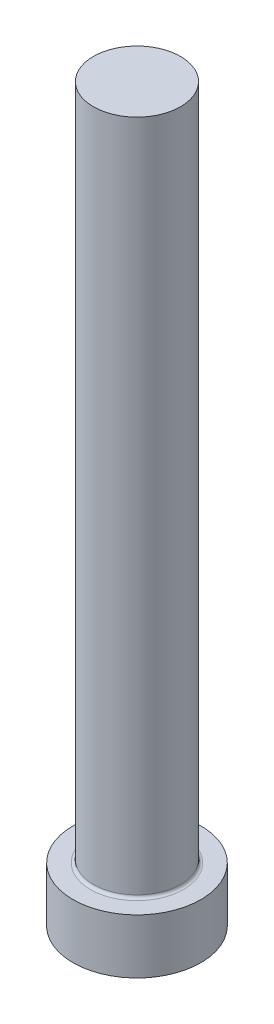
ISO-10303-21;
HEADER;
FILE_DESCRIPTION(('STEP AP214'),'2;1');
FILE_NAME('part.step','',(''),(''),'','','');
FILE_SCHEMA(('AUTOMOTIVE_DESIGN { 1 0 10303 214 1 1 1 1 }'));
ENDSEC;
DATA;
#1=APPLICATION_CONTEXT('core data for automotive mechanical design processes');
#2=APPLICATION_PROTOCOL_DEFINITION('international standard','automotive_design',2000,#1);
#3=PRODUCT_CONTEXT('',#1,'mechanical');
#4=PRODUCT('Part','Part','',(#3));
#5=PRODUCT_RELATED_PRODUCT_CATEGORY('part','',(#4));
#6=PRODUCT_DEFINITION_FORMATION('','',#4);
#7=PRODUCT_DEFINITION_CONTEXT('part definition',#1,'design');
#8=PRODUCT_DEFINITION('design','',#6,#7);
#9=PRODUCT_DEFINITION_SHAPE('','',#8);
#10=(LENGTH_UNIT() NAMED_UNIT(*) SI_UNIT(.MILLI.,.METRE.));
#11=(NAMED_UNIT(*) PLANE_ANGLE_UNIT() SI_UNIT($,.RADIAN.));
#12=(NAMED_UNIT(*) SI_UNIT($,.STERADIAN.) SOLID_ANGLE_UNIT());
#13=UNCERTAINTY_MEASURE_WITH_UNIT(LENGTH_MEASURE(1.E-05),#10,'distance_accuracy_value','');
#14=(GEOMETRIC_REPRESENTATION_CONTEXT(3) GLOBAL_UNCERTAINTY_ASSIGNED_CONTEXT((#13)) GLOBAL_UNIT_ASSIGNED_CONTEXT((#10,
#11,#12)) REPRESENTATION_CONTEXT('',''));
#15=CARTESIAN_POINT('',(0.,0.,0.));
#16=DIRECTION('',(0.,0.,1.));
#17=DIRECTION('',(1.,0.,0.));
#18=AXIS2_PLACEMENT_3D('',#15,#16,#17);
#19=CARTESIAN_POINT('',(0.,63.5,0.));
#20=DIRECTION('',(0.,-1.,0.));
#21=DIRECTION('',(0.,0.,-1.));
#22=AXIS2_PLACEMENT_3D('',#19,#20,#21);
#23=PLANE('',#22);
#24=CARTESIAN_POINT('',(0.,63.5,0.));
#25=DIRECTION('',(0.,1.,0.));
#26=DIRECTION('',(0.,0.,1.));
#27=AXIS2_PLACEMENT_3D('',#24,#25,#26);
#28=CIRCLE('',#27,3.7846);
#29=CARTESIAN_POINT('',(0.,63.5,3.7846));
#30=VERTEX_POINT('',#29);
#31=EDGE_CURVE('E10',#30,#30,#28,.T.);
#32=ORIENTED_EDGE('',*,*,#31,.T.);
#33=EDGE_LOOP('',(#32));
#34=FACE_BOUND('',#33,.T.);
#35=ADVANCED_FACE('F30',(#34),#23,.F.);
#36=CARTESIAN_POINT('',(0.,0.,0.));
#37=DIRECTION('',(0.,1.,0.));
#38=DIRECTION('',(0.,0.,1.));
#39=AXIS2_PLACEMENT_3D('',#36,#37,#38);
#40=CYLINDRICAL_SURFACE('',#39,3.7846);
#41=ORIENTED_EDGE('',*,*,#31,.F.);
#42=EDGE_LOOP('',(#41));
#43=FACE_BOUND('',#42,.T.);
#44=CARTESIAN_POINT('',(0.,5.0038,0.));
#45=DIRECTION('',(0.,1.,0.));
#46=DIRECTION('',(0.,0.,1.));
#47=AXIS2_PLACEMENT_3D('',#44,#45,#46);
#48=CIRCLE('',#47,3.7846);
#49=CARTESIAN_POINT('',(0.,5.0038,3.7846));
#50=VERTEX_POINT('',#49);
#51=EDGE_CURVE('E36',#50,#50,#48,.T.);
#52=ORIENTED_EDGE('',*,*,#51,.T.);
#53=EDGE_LOOP('',(#52));
#54=FACE_BOUND('',#53,.T.);
#55=ADVANCED_FACE('F65',(#43,#54),#40,.T.);
#56=CARTESIAN_POINT('',(0.,5.0038,0.));
#57=DIRECTION('',(0.,1.,0.));
#58=DIRECTION('',(0.,0.,1.));
#59=AXIS2_PLACEMENT_3D('',#56,#57,#58);
#60=TOROIDAL_SURFACE('',#59,4.0386,0.254);
#61=ORIENTED_EDGE('',*,*,#51,.F.);
#62=EDGE_LOOP('',(#61));
#63=FACE_BOUND('',#62,.T.);
#64=CARTESIAN_POINT('',(0.,4.7498,0.));
#65=DIRECTION('',(0.,1.,0.));
#66=DIRECTION('',(0.,0.,1.));
#67=AXIS2_PLACEMENT_3D('',#64,#65,#66);
#68=CIRCLE('',#67,4.0386);
#69=CARTESIAN_POINT('',(0.,4.7498,4.0386));
#70=VERTEX_POINT('',#69);
#71=EDGE_CURVE('E40',#70,#70,#68,.T.);
#72=ORIENTED_EDGE('',*,*,#71,.T.);
#73=EDGE_LOOP('',(#72));
#74=FACE_BOUND('',#73,.T.);
#75=ADVANCED_FACE('F69',(#63,#74),#60,.F.);
#76=CARTESIAN_POINT('',(5.5499,4.7498,0.));
#77=DIRECTION('',(0.,-1.,0.));
#78=DIRECTION('',(0.,0.,-1.));
#79=AXIS2_PLACEMENT_3D('',#76,#77,#78);
#80=PLANE('',#79);
#81=ORIENTED_EDGE('',*,*,#71,.F.);
#82=EDGE_LOOP('',(#81));
#83=FACE_BOUND('',#82,.T.);
#84=CARTESIAN_POINT('',(0.,4.7498,0.));
#85=DIRECTION('',(0.,1.,0.));
#86=DIRECTION('',(0.,0.,1.));
#87=AXIS2_PLACEMENT_3D('',#84,#85,#86);
#88=CIRCLE('',#87,5.5499);
#89=CARTESIAN_POINT('',(0.,4.7498,5.5499));
#90=VERTEX_POINT('',#89);
#91=EDGE_CURVE('E44',#90,#90,#88,.T.);
#92=ORIENTED_EDGE('',*,*,#91,.T.);
#93=EDGE_LOOP('',(#92));
#94=FACE_BOUND('',#93,.T.);
#95=ADVANCED_FACE('F61',(#83,#94),#80,.F.);
#96=CARTESIAN_POINT('',(0.,0.,0.));
#97=DIRECTION('',(0.,1.,0.));
#98=DIRECTION('',(0.,0.,1.));
#99=AXIS2_PLACEMENT_3D('',#96,#97,#98);
#100=CYLINDRICAL_SURFACE('',#99,5.5499);
#101=ORIENTED_EDGE('',*,*,#91,.F.);
#102=EDGE_LOOP('',(#101));
#103=FACE_BOUND('',#102,.T.);
#104=CARTESIAN_POINT('',(0.,0.,0.));
#105=DIRECTION('',(0.,1.,0.));
#106=DIRECTION('',(0.,0.,1.));
#107=AXIS2_PLACEMENT_3D('',#104,#105,#106);
#108=CIRCLE('',#107,5.5499);
#109=CARTESIAN_POINT('',(0.,0.,5.5499));
#110=VERTEX_POINT('',#109);
#111=EDGE_CURVE('E49',#110,#110,#108,.T.);
#112=ORIENTED_EDGE('',*,*,#111,.T.);
#113=EDGE_LOOP('',(#112));
#114=FACE_BOUND('',#113,.T.);
#115=ADVANCED_FACE('F53',(#103,#114),#100,.T.);
#116=CARTESIAN_POINT('',(0.,0.,0.));
#117=DIRECTION('',(0.,1.,0.));
#118=DIRECTION('',(0.,0.,1.));
#119=AXIS2_PLACEMENT_3D('',#116,#117,#118);
#120=PLANE('',#119);
#121=ORIENTED_EDGE('',*,*,#111,.F.);
#122=EDGE_LOOP('',(#121));
#123=FACE_BOUND('',#122,.T.);
#124=ADVANCED_FACE('F55',(#123),#120,.F.);
#125=CLOSED_SHELL('',(#35,#55,#75,#95,#115,#124));
#126=MANIFOLD_SOLID_BREP('B2',#125);
#127=ADVANCED_BREP_SHAPE_REPRESENTATION('',(#18,#126),#14);
#128=SHAPE_DEFINITION_REPRESENTATION(#9,#127);
ENDSEC;
END-ISO-10303-21;
